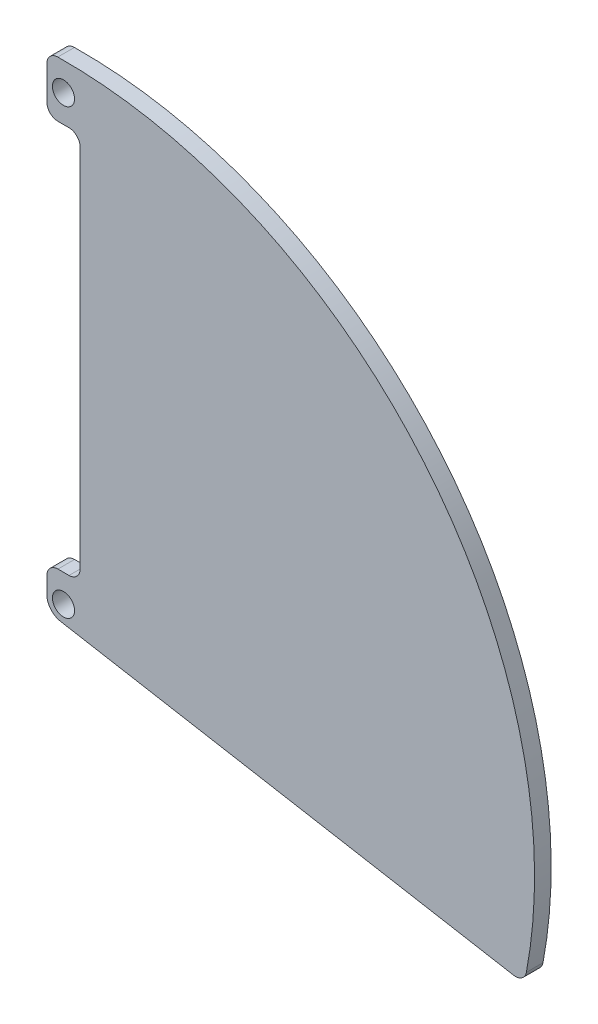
ISO-10303-21;
HEADER;
FILE_DESCRIPTION(('STEP AP214'),'2;1');
FILE_NAME('part.step','',(''),(''),'','','');
FILE_SCHEMA(('AUTOMOTIVE_DESIGN { 1 0 10303 214 1 1 1 1 }'));
ENDSEC;
DATA;
#1=APPLICATION_CONTEXT('core data for automotive mechanical design processes');
#2=APPLICATION_PROTOCOL_DEFINITION('international standard','automotive_design',2000,#1);
#3=PRODUCT_CONTEXT('',#1,'mechanical');
#4=PRODUCT('Part','Part','',(#3));
#5=PRODUCT_RELATED_PRODUCT_CATEGORY('part','',(#4));
#6=PRODUCT_DEFINITION_FORMATION('','',#4);
#7=PRODUCT_DEFINITION_CONTEXT('part definition',#1,'design');
#8=PRODUCT_DEFINITION('design','',#6,#7);
#9=PRODUCT_DEFINITION_SHAPE('','',#8);
#10=(LENGTH_UNIT() NAMED_UNIT(*) SI_UNIT(.MILLI.,.METRE.));
#11=(NAMED_UNIT(*) PLANE_ANGLE_UNIT() SI_UNIT($,.RADIAN.));
#12=(NAMED_UNIT(*) SI_UNIT($,.STERADIAN.) SOLID_ANGLE_UNIT());
#13=UNCERTAINTY_MEASURE_WITH_UNIT(LENGTH_MEASURE(1.E-05),#10,'distance_accuracy_value','');
#14=(GEOMETRIC_REPRESENTATION_CONTEXT(3) GLOBAL_UNCERTAINTY_ASSIGNED_CONTEXT((#13)) GLOBAL_UNIT_ASSIGNED_CONTEXT((#10,
#11,#12)) REPRESENTATION_CONTEXT('',''));
#15=CARTESIAN_POINT('',(0.,0.,0.));
#16=DIRECTION('',(0.,0.,1.));
#17=DIRECTION('',(1.,0.,0.));
#18=AXIS2_PLACEMENT_3D('',#15,#16,#17);
#19=CARTESIAN_POINT('',(-15.,0.,15.));
#20=DIRECTION('',(-1.,0.,0.));
#21=DIRECTION('',(0.,0.,1.));
#22=AXIS2_PLACEMENT_3D('',#19,#20,#21);
#23=PLANE('',#22);
#24=DIRECTION('',(0.,1.,0.));
#25=VECTOR('',#24,1.);
#26=CARTESIAN_POINT('',(-15.,0.,15.));
#27=LINE('',#26,#25);
#28=CARTESIAN_POINT('',(-15.,0.,15.));
#29=VERTEX_POINT('',#28);
#30=CARTESIAN_POINT('',(-15.,15.,15.));
#31=VERTEX_POINT('',#30);
#32=EDGE_CURVE('E145',#29,#31,#27,.T.);
#33=ORIENTED_EDGE('',*,*,#32,.T.);
#34=DIRECTION('',(0.,0.,-1.));
#35=VECTOR('',#34,1.);
#36=CARTESIAN_POINT('',(-15.,15.,15.));
#37=LINE('',#36,#35);
#38=CARTESIAN_POINT('',(-15.,15.,0.));
#39=VERTEX_POINT('',#38);
#40=EDGE_CURVE('E223',#31,#39,#37,.T.);
#41=ORIENTED_EDGE('',*,*,#40,.T.);
#42=DIRECTION('',(0.,1.,0.));
#43=VECTOR('',#42,1.);
#44=CARTESIAN_POINT('',(-15.,0.,0.));
#45=LINE('',#44,#43);
#46=CARTESIAN_POINT('',(-15.,0.,0.));
#47=VERTEX_POINT('',#46);
#48=EDGE_CURVE('E148',#47,#39,#45,.T.);
#49=ORIENTED_EDGE('',*,*,#48,.F.);
#50=DIRECTION('',(0.,0.,-1.));
#51=VECTOR('',#50,1.);
#52=CARTESIAN_POINT('',(-15.,0.,15.));
#53=LINE('',#52,#51);
#54=EDGE_CURVE('E141',#29,#47,#53,.T.);
#55=ORIENTED_EDGE('',*,*,#54,.F.);
#56=EDGE_LOOP('',(#33,#41,#49,#55));
#57=FACE_BOUND('',#56,.T.);
#58=ADVANCED_FACE('F39',(#57),#23,.T.);
#59=CARTESIAN_POINT('',(-15.,385.,15.));
#60=VERTEX_POINT('',#59);
#61=CARTESIAN_POINT('',(-15.,415.234521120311,15.));
#62=VERTEX_POINT('',#61);
#63=EDGE_CURVE('E166',#60,#62,#27,.T.);
#64=ORIENTED_EDGE('',*,*,#63,.T.);
#65=DIRECTION('',(0.,0.,-1.));
#66=VECTOR('',#65,1.);
#67=CARTESIAN_POINT('',(-15.,415.234521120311,15.));
#68=LINE('',#67,#66);
#69=CARTESIAN_POINT('',(-15.,415.234521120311,0.));
#70=VERTEX_POINT('',#69);
#71=EDGE_CURVE('E220',#62,#70,#68,.T.);
#72=ORIENTED_EDGE('',*,*,#71,.T.);
#73=CARTESIAN_POINT('',(-15.,385.,0.));
#74=VERTEX_POINT('',#73);
#75=EDGE_CURVE('E183',#74,#70,#45,.T.);
#76=ORIENTED_EDGE('',*,*,#75,.F.);
#77=DIRECTION('',(0.,0.,-1.));
#78=VECTOR('',#77,1.);
#79=CARTESIAN_POINT('',(-15.,385.,15.));
#80=LINE('',#79,#78);
#81=EDGE_CURVE('E218',#74,#60,#80,.F.);
#82=ORIENTED_EDGE('',*,*,#81,.T.);
#83=EDGE_LOOP('',(#64,#72,#76,#82));
#84=FACE_BOUND('',#83,.T.);
#85=ADVANCED_FACE('F299',(#84),#23,.T.);
#86=CARTESIAN_POINT('',(0.,0.,15.));
#87=DIRECTION('',(0.,0.,1.));
#88=DIRECTION('',(1.,0.,0.));
#89=AXIS2_PLACEMENT_3D('',#86,#87,#88);
#90=PLANE('',#89);
#91=CARTESIAN_POINT('',(0.,0.,15.));
#92=DIRECTION('',(0.,0.,1.));
#93=DIRECTION('',(1.,0.,0.));
#94=AXIS2_PLACEMENT_3D('',#91,#92,#93);
#95=CIRCLE('',#94,10.);
#96=CARTESIAN_POINT('',(10.,0.,15.));
#97=VERTEX_POINT('',#96);
#98=EDGE_CURVE('E174',#97,#97,#95,.T.);
#99=ORIENTED_EDGE('',*,*,#98,.F.);
#100=EDGE_LOOP('',(#99));
#101=FACE_BOUND('',#100,.T.);
#102=CARTESIAN_POINT('',(0.,400.,15.));
#103=DIRECTION('',(0.,0.,1.));
#104=DIRECTION('',(1.,0.,0.));
#105=AXIS2_PLACEMENT_3D('',#102,#103,#104);
#106=CIRCLE('',#105,10.);
#107=CARTESIAN_POINT('',(10.,400.,15.));
#108=VERTEX_POINT('',#107);
#109=EDGE_CURVE('E177',#108,#108,#106,.T.);
#110=ORIENTED_EDGE('',*,*,#109,.F.);
#111=EDGE_LOOP('',(#110));
#112=FACE_BOUND('',#111,.T.);
#113=DIRECTION('',(0.984807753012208,-0.173648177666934,0.));
#114=VECTOR('',#113,1.);
#115=CARTESIAN_POINT('',(-2.60472266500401,-14.7721162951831,15.));
#116=LINE('',#115,#114);
#117=CARTESIAN_POINT('',(-2.60472266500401,-14.7721162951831,15.));
#118=VERTEX_POINT('',#117);
#119=CARTESIAN_POINT('',(406.32145305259,-86.8768341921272,15.));
#120=VERTEX_POINT('',#119);
#121=EDGE_CURVE('E160',#118,#120,#116,.T.);
#122=ORIENTED_EDGE('',*,*,#121,.T.);
#123=CARTESIAN_POINT('',(408.057934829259,-77.0287566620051,15.));
#124=DIRECTION('',(0.,0.,1.));
#125=DIRECTION('',(1.,0.,0.));
#126=AXIS2_PLACEMENT_3D('',#123,#124,#125);
#127=CIRCLE('',#126,10.);
#128=CARTESIAN_POINT('',(417.884390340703,-78.8836884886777,15.));
#129=VERTEX_POINT('',#128);
#130=EDGE_CURVE('E216',#120,#129,#127,.T.);
#131=ORIENTED_EDGE('',*,*,#130,.T.);
#132=CARTESIAN_POINT('',(0.,0.,15.));
#133=DIRECTION('',(0.,0.,1.));
#134=DIRECTION('',(1.,0.,0.));
#135=AXIS2_PLACEMENT_3D('',#132,#133,#134);
#136=CIRCLE('',#135,425.264623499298);
#137=CARTESIAN_POINT('',(-5.12040515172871,425.233796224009,15.));
#138=VERTEX_POINT('',#137);
#139=EDGE_CURVE('E169',#138,#129,#136,.F.);
#140=ORIENTED_EDGE('',*,*,#139,.F.);
#141=CARTESIAN_POINT('',(-5.,415.234521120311,15.));
#142=DIRECTION('',(0.,0.,1.));
#143=DIRECTION('',(1.,0.,0.));
#144=AXIS2_PLACEMENT_3D('',#141,#142,#143);
#145=CIRCLE('',#144,10.);
#146=EDGE_CURVE('E214',#138,#62,#145,.T.);
#147=ORIENTED_EDGE('',*,*,#146,.T.);
#148=ORIENTED_EDGE('',*,*,#63,.F.);
#149=CARTESIAN_POINT('',(-5.,385.,15.));
#150=DIRECTION('',(0.,0.,1.));
#151=DIRECTION('',(1.,0.,0.));
#152=AXIS2_PLACEMENT_3D('',#149,#150,#151);
#153=CIRCLE('',#152,10.);
#154=CARTESIAN_POINT('',(-5.,375.,15.));
#155=VERTEX_POINT('',#154);
#156=EDGE_CURVE('E54',#60,#155,#153,.T.);
#157=ORIENTED_EDGE('',*,*,#156,.T.);
#158=DIRECTION('',(-1.,0.,0.));
#159=VECTOR('',#158,1.);
#160=CARTESIAN_POINT('',(-15.,375.,15.));
#161=LINE('',#160,#159);
#162=CARTESIAN_POINT('',(5.00000000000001,375.,15.));
#163=VERTEX_POINT('',#162);
#164=EDGE_CURVE('E184',#163,#155,#161,.T.);
#165=ORIENTED_EDGE('',*,*,#164,.F.);
#166=CARTESIAN_POINT('',(5.00000000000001,365.,15.));
#167=DIRECTION('',(0.,0.,1.));
#168=DIRECTION('',(1.,0.,0.));
#169=AXIS2_PLACEMENT_3D('',#166,#167,#168);
#170=CIRCLE('',#169,10.);
#171=CARTESIAN_POINT('',(15.,365.,15.));
#172=VERTEX_POINT('',#171);
#173=EDGE_CURVE('E11',#163,#172,#170,.F.);
#174=ORIENTED_EDGE('',*,*,#173,.T.);
#175=DIRECTION('',(0.,1.,0.));
#176=VECTOR('',#175,1.);
#177=CARTESIAN_POINT('',(15.,375.,15.));
#178=LINE('',#177,#176);
#179=CARTESIAN_POINT('',(15.,35.,15.));
#180=VERTEX_POINT('',#179);
#181=EDGE_CURVE('E258',#180,#172,#178,.T.);
#182=ORIENTED_EDGE('',*,*,#181,.F.);
#183=CARTESIAN_POINT('',(5.00000000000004,35.,15.));
#184=DIRECTION('',(0.,0.,1.));
#185=DIRECTION('',(1.,0.,0.));
#186=AXIS2_PLACEMENT_3D('',#183,#184,#185);
#187=CIRCLE('',#186,10.);
#188=CARTESIAN_POINT('',(5.00000000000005,25.,15.));
#189=VERTEX_POINT('',#188);
#190=EDGE_CURVE('E241',#180,#189,#187,.F.);
#191=ORIENTED_EDGE('',*,*,#190,.T.);
#192=DIRECTION('',(1.,0.,0.));
#193=VECTOR('',#192,1.);
#194=CARTESIAN_POINT('',(15.,25.,15.));
#195=LINE('',#194,#193);
#196=CARTESIAN_POINT('',(-5.00000000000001,25.,15.));
#197=VERTEX_POINT('',#196);
#198=EDGE_CURVE('E253',#197,#189,#195,.T.);
#199=ORIENTED_EDGE('',*,*,#198,.F.);
#200=CARTESIAN_POINT('',(-5.,15.,15.));
#201=DIRECTION('',(0.,0.,1.));
#202=DIRECTION('',(1.,0.,0.));
#203=AXIS2_PLACEMENT_3D('',#200,#201,#202);
#204=CIRCLE('',#203,10.);
#205=EDGE_CURVE('E165',#197,#31,#204,.T.);
#206=ORIENTED_EDGE('',*,*,#205,.T.);
#207=ORIENTED_EDGE('',*,*,#32,.F.);
#208=CARTESIAN_POINT('',(0.,0.,15.));
#209=DIRECTION('',(0.,0.,1.));
#210=DIRECTION('',(1.,0.,0.));
#211=AXIS2_PLACEMENT_3D('',#208,#209,#210);
#212=CIRCLE('',#211,15.);
#213=EDGE_CURVE('E155',#29,#118,#212,.T.);
#214=ORIENTED_EDGE('',*,*,#213,.T.);
#215=EDGE_LOOP('',(#122,#131,#140,#147,#148,#157,#165,#174,#182,#191,#199,#206,#207,#214));
#216=FACE_BOUND('',#215,.T.);
#217=ADVANCED_FACE('F162',(#101,#112,#216),#90,.T.);
#218=CARTESIAN_POINT('',(0.,0.,0.));
#219=DIRECTION('',(0.,0.,1.));
#220=DIRECTION('',(1.,0.,0.));
#221=AXIS2_PLACEMENT_3D('',#218,#219,#220);
#222=PLANE('',#221);
#223=CARTESIAN_POINT('',(0.,400.,0.));
#224=DIRECTION('',(0.,0.,1.));
#225=DIRECTION('',(1.,0.,0.));
#226=AXIS2_PLACEMENT_3D('',#223,#224,#225);
#227=CIRCLE('',#226,10.);
#228=CARTESIAN_POINT('',(10.,400.,0.));
#229=VERTEX_POINT('',#228);
#230=EDGE_CURVE('E194',#229,#229,#227,.T.);
#231=ORIENTED_EDGE('',*,*,#230,.T.);
#232=EDGE_LOOP('',(#231));
#233=FACE_BOUND('',#232,.T.);
#234=CARTESIAN_POINT('',(0.,0.,0.));
#235=DIRECTION('',(0.,0.,1.));
#236=DIRECTION('',(1.,0.,0.));
#237=AXIS2_PLACEMENT_3D('',#234,#235,#236);
#238=CIRCLE('',#237,10.);
#239=CARTESIAN_POINT('',(10.,0.,0.));
#240=VERTEX_POINT('',#239);
#241=EDGE_CURVE('E191',#240,#240,#238,.T.);
#242=ORIENTED_EDGE('',*,*,#241,.T.);
#243=EDGE_LOOP('',(#242));
#244=FACE_BOUND('',#243,.T.);
#245=CARTESIAN_POINT('',(0.,0.,0.));
#246=DIRECTION('',(0.,0.,1.));
#247=DIRECTION('',(1.,0.,0.));
#248=AXIS2_PLACEMENT_3D('',#245,#246,#247);
#249=CIRCLE('',#248,425.264623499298);
#250=CARTESIAN_POINT('',(-5.12040515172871,425.233796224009,0.));
#251=VERTEX_POINT('',#250);
#252=CARTESIAN_POINT('',(417.884390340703,-78.8836884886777,0.));
#253=VERTEX_POINT('',#252);
#254=EDGE_CURVE('E180',#251,#253,#249,.F.);
#255=ORIENTED_EDGE('',*,*,#254,.T.);
#256=CARTESIAN_POINT('',(408.057934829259,-77.0287566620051,0.));
#257=DIRECTION('',(0.,0.,1.));
#258=DIRECTION('',(1.,0.,0.));
#259=AXIS2_PLACEMENT_3D('',#256,#257,#258);
#260=CIRCLE('',#259,10.);
#261=CARTESIAN_POINT('',(406.32145305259,-86.8768341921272,0.));
#262=VERTEX_POINT('',#261);
#263=EDGE_CURVE('E208',#253,#262,#260,.F.);
#264=ORIENTED_EDGE('',*,*,#263,.T.);
#265=DIRECTION('',(0.984807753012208,-0.173648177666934,0.));
#266=VECTOR('',#265,1.);
#267=CARTESIAN_POINT('',(-2.60472266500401,-14.7721162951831,0.));
#268=LINE('',#267,#266);
#269=CARTESIAN_POINT('',(-2.60472266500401,-14.7721162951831,0.));
#270=VERTEX_POINT('',#269);
#271=EDGE_CURVE('E188',#270,#262,#268,.T.);
#272=ORIENTED_EDGE('',*,*,#271,.F.);
#273=CARTESIAN_POINT('',(0.,0.,0.));
#274=DIRECTION('',(0.,0.,1.));
#275=DIRECTION('',(1.,0.,0.));
#276=AXIS2_PLACEMENT_3D('',#273,#274,#275);
#277=CIRCLE('',#276,15.);
#278=EDGE_CURVE('E186',#47,#270,#277,.T.);
#279=ORIENTED_EDGE('',*,*,#278,.F.);
#280=ORIENTED_EDGE('',*,*,#48,.T.);
#281=CARTESIAN_POINT('',(-5.,15.,0.));
#282=DIRECTION('',(0.,0.,1.));
#283=DIRECTION('',(1.,0.,0.));
#284=AXIS2_PLACEMENT_3D('',#281,#282,#283);
#285=CIRCLE('',#284,10.);
#286=CARTESIAN_POINT('',(-5.00000000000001,25.,0.));
#287=VERTEX_POINT('',#286);
#288=EDGE_CURVE('E204',#39,#287,#285,.F.);
#289=ORIENTED_EDGE('',*,*,#288,.T.);
#290=DIRECTION('',(1.,0.,0.));
#291=VECTOR('',#290,1.);
#292=CARTESIAN_POINT('',(15.,25.,0.));
#293=LINE('',#292,#291);
#294=CARTESIAN_POINT('',(5.00000000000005,25.,0.));
#295=VERTEX_POINT('',#294);
#296=EDGE_CURVE('E268',#287,#295,#293,.T.);
#297=ORIENTED_EDGE('',*,*,#296,.T.);
#298=CARTESIAN_POINT('',(5.00000000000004,35.,0.));
#299=DIRECTION('',(0.,0.,1.));
#300=DIRECTION('',(1.,0.,0.));
#301=AXIS2_PLACEMENT_3D('',#298,#299,#300);
#302=CIRCLE('',#301,10.);
#303=CARTESIAN_POINT('',(15.,35.,0.));
#304=VERTEX_POINT('',#303);
#305=EDGE_CURVE('E239',#295,#304,#302,.T.);
#306=ORIENTED_EDGE('',*,*,#305,.T.);
#307=DIRECTION('',(0.,1.,0.));
#308=VECTOR('',#307,1.);
#309=CARTESIAN_POINT('',(15.,375.,0.));
#310=LINE('',#309,#308);
#311=CARTESIAN_POINT('',(15.,365.,0.));
#312=VERTEX_POINT('',#311);
#313=EDGE_CURVE('E248',#304,#312,#310,.T.);
#314=ORIENTED_EDGE('',*,*,#313,.T.);
#315=CARTESIAN_POINT('',(5.00000000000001,365.,0.));
#316=DIRECTION('',(0.,0.,1.));
#317=DIRECTION('',(1.,0.,0.));
#318=AXIS2_PLACEMENT_3D('',#315,#316,#317);
#319=CIRCLE('',#318,10.);
#320=CARTESIAN_POINT('',(5.00000000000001,375.,0.));
#321=VERTEX_POINT('',#320);
#322=EDGE_CURVE('E47',#312,#321,#319,.T.);
#323=ORIENTED_EDGE('',*,*,#322,.T.);
#324=DIRECTION('',(-1.,0.,0.));
#325=VECTOR('',#324,1.);
#326=CARTESIAN_POINT('',(-15.,375.,0.));
#327=LINE('',#326,#325);
#328=CARTESIAN_POINT('',(-5.,375.,0.));
#329=VERTEX_POINT('',#328);
#330=EDGE_CURVE('E246',#321,#329,#327,.T.);
#331=ORIENTED_EDGE('',*,*,#330,.T.);
#332=CARTESIAN_POINT('',(-5.,385.,0.));
#333=DIRECTION('',(0.,0.,1.));
#334=DIRECTION('',(1.,0.,0.));
#335=AXIS2_PLACEMENT_3D('',#332,#333,#334);
#336=CIRCLE('',#335,10.);
#337=EDGE_CURVE('E202',#329,#74,#336,.F.);
#338=ORIENTED_EDGE('',*,*,#337,.T.);
#339=ORIENTED_EDGE('',*,*,#75,.T.);
#340=CARTESIAN_POINT('',(-5.,415.234521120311,0.));
#341=DIRECTION('',(0.,0.,1.));
#342=DIRECTION('',(1.,0.,0.));
#343=AXIS2_PLACEMENT_3D('',#340,#341,#342);
#344=CIRCLE('',#343,10.);
#345=EDGE_CURVE('E206',#70,#251,#344,.F.);
#346=ORIENTED_EDGE('',*,*,#345,.T.);
#347=EDGE_LOOP('',(#255,#264,#272,#279,#280,#289,#297,#306,#314,#323,#331,#338,#339,#346));
#348=FACE_BOUND('',#347,.T.);
#349=ADVANCED_FACE('F245',(#233,#244,#348),#222,.F.);
#350=CARTESIAN_POINT('',(0.,0.,15.));
#351=DIRECTION('',(0.,0.,-1.));
#352=DIRECTION('',(-1.,0.,0.));
#353=AXIS2_PLACEMENT_3D('',#350,#351,#352);
#354=CYLINDRICAL_SURFACE('',#353,425.264623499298);
#355=ORIENTED_EDGE('',*,*,#139,.T.);
#356=DIRECTION('',(0.,0.,-1.));
#357=VECTOR('',#356,1.);
#358=CARTESIAN_POINT('',(417.884390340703,-78.8836884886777,15.));
#359=LINE('',#358,#357);
#360=EDGE_CURVE('E199',#129,#253,#359,.T.);
#361=ORIENTED_EDGE('',*,*,#360,.T.);
#362=ORIENTED_EDGE('',*,*,#254,.F.);
#363=DIRECTION('',(0.,0.,-1.));
#364=VECTOR('',#363,1.);
#365=CARTESIAN_POINT('',(-5.12040515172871,425.233796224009,15.));
#366=LINE('',#365,#364);
#367=EDGE_CURVE('E151',#251,#138,#366,.F.);
#368=ORIENTED_EDGE('',*,*,#367,.T.);
#369=EDGE_LOOP('',(#355,#361,#362,#368));
#370=FACE_BOUND('',#369,.T.);
#371=ADVANCED_FACE('F290',(#370),#354,.T.);
#372=CARTESIAN_POINT('',(0.,0.,15.));
#373=DIRECTION('',(0.,0.,-1.));
#374=DIRECTION('',(-1.,0.,0.));
#375=AXIS2_PLACEMENT_3D('',#372,#373,#374);
#376=CYLINDRICAL_SURFACE('',#375,15.);
#377=ORIENTED_EDGE('',*,*,#278,.T.);
#378=DIRECTION('',(0.,0.,-1.));
#379=VECTOR('',#378,1.);
#380=CARTESIAN_POINT('',(-2.60472266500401,-14.7721162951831,15.));
#381=LINE('',#380,#379);
#382=EDGE_CURVE('E152',#118,#270,#381,.T.);
#383=ORIENTED_EDGE('',*,*,#382,.F.);
#384=ORIENTED_EDGE('',*,*,#213,.F.);
#385=ORIENTED_EDGE('',*,*,#54,.T.);
#386=EDGE_LOOP('',(#377,#383,#384,#385));
#387=FACE_BOUND('',#386,.T.);
#388=ADVANCED_FACE('F156',(#387),#376,.T.);
#389=CARTESIAN_POINT('',(0.,0.,15.));
#390=DIRECTION('',(0.,0.,-1.));
#391=DIRECTION('',(-1.,0.,0.));
#392=AXIS2_PLACEMENT_3D('',#389,#390,#391);
#393=CYLINDRICAL_SURFACE('',#392,10.);
#394=ORIENTED_EDGE('',*,*,#98,.T.);
#395=EDGE_LOOP('',(#394));
#396=FACE_BOUND('',#395,.T.);
#397=ORIENTED_EDGE('',*,*,#241,.F.);
#398=EDGE_LOOP('',(#397));
#399=FACE_BOUND('',#398,.T.);
#400=ADVANCED_FACE('F439',(#396,#399),#393,.F.);
#401=CARTESIAN_POINT('',(-2.60472266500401,-14.7721162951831,15.));
#402=DIRECTION('',(0.173648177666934,0.984807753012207,0.));
#403=DIRECTION('',(-0.984807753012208,0.173648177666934,0.));
#404=AXIS2_PLACEMENT_3D('',#401,#402,#403);
#405=PLANE('',#404);
#406=ORIENTED_EDGE('',*,*,#271,.T.);
#407=DIRECTION('',(0.,0.,1.));
#408=VECTOR('',#407,1.);
#409=CARTESIAN_POINT('',(406.32145305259,-86.8768341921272,15.));
#410=LINE('',#409,#408);
#411=EDGE_CURVE('E210',#262,#120,#410,.T.);
#412=ORIENTED_EDGE('',*,*,#411,.T.);
#413=ORIENTED_EDGE('',*,*,#121,.F.);
#414=ORIENTED_EDGE('',*,*,#382,.T.);
#415=EDGE_LOOP('',(#406,#412,#413,#414));
#416=FACE_BOUND('',#415,.T.);
#417=ADVANCED_FACE('F280',(#416),#405,.F.);
#418=CARTESIAN_POINT('',(0.,400.,15.));
#419=DIRECTION('',(0.,0.,-1.));
#420=DIRECTION('',(-1.,0.,0.));
#421=AXIS2_PLACEMENT_3D('',#418,#419,#420);
#422=CYLINDRICAL_SURFACE('',#421,10.);
#423=ORIENTED_EDGE('',*,*,#109,.T.);
#424=EDGE_LOOP('',(#423));
#425=FACE_BOUND('',#424,.T.);
#426=ORIENTED_EDGE('',*,*,#230,.F.);
#427=EDGE_LOOP('',(#426));
#428=FACE_BOUND('',#427,.T.);
#429=ADVANCED_FACE('F387',(#425,#428),#422,.F.);
#430=CARTESIAN_POINT('',(15.,25.,15.));
#431=DIRECTION('',(0.,1.,0.));
#432=DIRECTION('',(-1.,0.,0.));
#433=AXIS2_PLACEMENT_3D('',#430,#431,#432);
#434=PLANE('',#433);
#435=ORIENTED_EDGE('',*,*,#296,.F.);
#436=DIRECTION('',(0.,0.,-1.));
#437=VECTOR('',#436,1.);
#438=CARTESIAN_POINT('',(-5.00000000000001,25.,15.));
#439=LINE('',#438,#437);
#440=EDGE_CURVE('E228',#287,#197,#439,.F.);
#441=ORIENTED_EDGE('',*,*,#440,.T.);
#442=ORIENTED_EDGE('',*,*,#198,.T.);
#443=DIRECTION('',(0.,0.,-1.));
#444=VECTOR('',#443,1.);
#445=CARTESIAN_POINT('',(5.00000000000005,25.,0.));
#446=LINE('',#445,#444);
#447=EDGE_CURVE('E225',#189,#295,#446,.T.);
#448=ORIENTED_EDGE('',*,*,#447,.T.);
#449=EDGE_LOOP('',(#435,#441,#442,#448));
#450=FACE_BOUND('',#449,.T.);
#451=ADVANCED_FACE('F274',(#450),#434,.T.);
#452=CARTESIAN_POINT('',(15.,375.,15.));
#453=DIRECTION('',(-1.,0.,0.));
#454=DIRECTION('',(0.,-1.,0.));
#455=AXIS2_PLACEMENT_3D('',#452,#453,#454);
#456=PLANE('',#455);
#457=ORIENTED_EDGE('',*,*,#313,.F.);
#458=DIRECTION('',(0.,0.,-1.));
#459=VECTOR('',#458,1.);
#460=CARTESIAN_POINT('',(15.,35.,15.));
#461=LINE('',#460,#459);
#462=EDGE_CURVE('E233',#304,#180,#461,.F.);
#463=ORIENTED_EDGE('',*,*,#462,.T.);
#464=ORIENTED_EDGE('',*,*,#181,.T.);
#465=DIRECTION('',(0.,0.,-1.));
#466=VECTOR('',#465,1.);
#467=CARTESIAN_POINT('',(15.,365.,0.));
#468=LINE('',#467,#466);
#469=EDGE_CURVE('E230',#172,#312,#468,.T.);
#470=ORIENTED_EDGE('',*,*,#469,.T.);
#471=EDGE_LOOP('',(#457,#463,#464,#470));
#472=FACE_BOUND('',#471,.T.);
#473=ADVANCED_FACE('F261',(#472),#456,.T.);
#474=CARTESIAN_POINT('',(-15.,375.,15.));
#475=DIRECTION('',(0.,-1.,0.));
#476=DIRECTION('',(0.,0.,-1.));
#477=AXIS2_PLACEMENT_3D('',#474,#475,#476);
#478=PLANE('',#477);
#479=ORIENTED_EDGE('',*,*,#330,.F.);
#480=DIRECTION('',(0.,0.,-1.));
#481=VECTOR('',#480,1.);
#482=CARTESIAN_POINT('',(5.00000000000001,375.,15.));
#483=LINE('',#482,#481);
#484=EDGE_CURVE('E61',#321,#163,#483,.F.);
#485=ORIENTED_EDGE('',*,*,#484,.T.);
#486=ORIENTED_EDGE('',*,*,#164,.T.);
#487=DIRECTION('',(0.,0.,-1.));
#488=VECTOR('',#487,1.);
#489=CARTESIAN_POINT('',(-5.,375.,15.));
#490=LINE('',#489,#488);
#491=EDGE_CURVE('E235',#155,#329,#490,.T.);
#492=ORIENTED_EDGE('',*,*,#491,.T.);
#493=EDGE_LOOP('',(#479,#485,#486,#492));
#494=FACE_BOUND('',#493,.T.);
#495=ADVANCED_FACE('F251',(#494),#478,.T.);
#496=CARTESIAN_POINT('',(408.057934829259,-77.0287566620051,15.));
#497=DIRECTION('',(0.,0.,-1.));
#498=DIRECTION('',(-1.,0.,0.));
#499=AXIS2_PLACEMENT_3D('',#496,#497,#498);
#500=CYLINDRICAL_SURFACE('',#499,10.);
#501=ORIENTED_EDGE('',*,*,#130,.F.);
#502=ORIENTED_EDGE('',*,*,#411,.F.);
#503=ORIENTED_EDGE('',*,*,#263,.F.);
#504=ORIENTED_EDGE('',*,*,#360,.F.);
#505=EDGE_LOOP('',(#501,#502,#503,#504));
#506=FACE_BOUND('',#505,.T.);
#507=ADVANCED_FACE('F287',(#506),#500,.T.);
#508=CARTESIAN_POINT('',(-5.,415.234521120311,15.));
#509=DIRECTION('',(0.,0.,-1.));
#510=DIRECTION('',(-1.,0.,0.));
#511=AXIS2_PLACEMENT_3D('',#508,#509,#510);
#512=CYLINDRICAL_SURFACE('',#511,10.);
#513=ORIENTED_EDGE('',*,*,#146,.F.);
#514=ORIENTED_EDGE('',*,*,#367,.F.);
#515=ORIENTED_EDGE('',*,*,#345,.F.);
#516=ORIENTED_EDGE('',*,*,#71,.F.);
#517=EDGE_LOOP('',(#513,#514,#515,#516));
#518=FACE_BOUND('',#517,.T.);
#519=ADVANCED_FACE('F297',(#518),#512,.T.);
#520=CARTESIAN_POINT('',(-5.,15.,15.));
#521=DIRECTION('',(0.,0.,-1.));
#522=DIRECTION('',(-1.,0.,0.));
#523=AXIS2_PLACEMENT_3D('',#520,#521,#522);
#524=CYLINDRICAL_SURFACE('',#523,10.);
#525=ORIENTED_EDGE('',*,*,#205,.F.);
#526=ORIENTED_EDGE('',*,*,#440,.F.);
#527=ORIENTED_EDGE('',*,*,#288,.F.);
#528=ORIENTED_EDGE('',*,*,#40,.F.);
#529=EDGE_LOOP('',(#525,#526,#527,#528));
#530=FACE_BOUND('',#529,.T.);
#531=ADVANCED_FACE('F277',(#530),#524,.T.);
#532=CARTESIAN_POINT('',(5.00000000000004,35.,15.));
#533=DIRECTION('',(0.,0.,1.));
#534=DIRECTION('',(1.,0.,0.));
#535=AXIS2_PLACEMENT_3D('',#532,#533,#534);
#536=CYLINDRICAL_SURFACE('',#535,10.);
#537=ORIENTED_EDGE('',*,*,#190,.F.);
#538=ORIENTED_EDGE('',*,*,#462,.F.);
#539=ORIENTED_EDGE('',*,*,#305,.F.);
#540=ORIENTED_EDGE('',*,*,#447,.F.);
#541=EDGE_LOOP('',(#537,#538,#539,#540));
#542=FACE_BOUND('',#541,.T.);
#543=ADVANCED_FACE('F306',(#542),#536,.F.);
#544=CARTESIAN_POINT('',(5.00000000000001,365.,15.));
#545=DIRECTION('',(0.,0.,1.));
#546=DIRECTION('',(1.,0.,0.));
#547=AXIS2_PLACEMENT_3D('',#544,#545,#546);
#548=CYLINDRICAL_SURFACE('',#547,10.);
#549=ORIENTED_EDGE('',*,*,#173,.F.);
#550=ORIENTED_EDGE('',*,*,#484,.F.);
#551=ORIENTED_EDGE('',*,*,#322,.F.);
#552=ORIENTED_EDGE('',*,*,#469,.F.);
#553=EDGE_LOOP('',(#549,#550,#551,#552));
#554=FACE_BOUND('',#553,.T.);
#555=ADVANCED_FACE('F255',(#554),#548,.F.);
#556=CARTESIAN_POINT('',(-5.,385.,15.));
#557=DIRECTION('',(0.,0.,-1.));
#558=DIRECTION('',(-1.,0.,0.));
#559=AXIS2_PLACEMENT_3D('',#556,#557,#558);
#560=CYLINDRICAL_SURFACE('',#559,10.);
#561=ORIENTED_EDGE('',*,*,#156,.F.);
#562=ORIENTED_EDGE('',*,*,#81,.F.);
#563=ORIENTED_EDGE('',*,*,#337,.F.);
#564=ORIENTED_EDGE('',*,*,#491,.F.);
#565=EDGE_LOOP('',(#561,#562,#563,#564));
#566=FACE_BOUND('',#565,.T.);
#567=ADVANCED_FACE('F41',(#566),#560,.T.);
#568=CLOSED_SHELL('',(#58,#85,#217,#349,#371,#388,#400,#417,#429,#451,#473,#495,#507,#519,#531,
#543,#555,#567));
#569=MANIFOLD_SOLID_BREP('B2',#568);
#570=ADVANCED_BREP_SHAPE_REPRESENTATION('',(#18,#569),#14);
#571=SHAPE_DEFINITION_REPRESENTATION(#9,#570);
ENDSEC;
END-ISO-10303-21;
